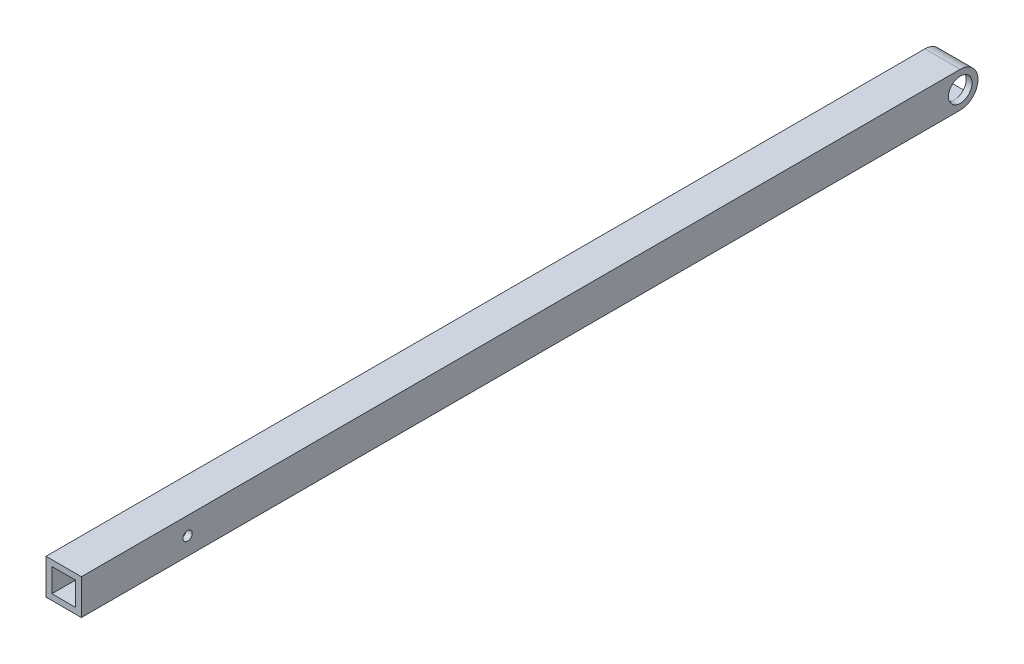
from build123d import *

# Parameters (mm, degrees)
SKETCH1_W           = 19.05
SKETCH1_H           = 19.05
SKETCH1_W_2         = 12.7
SKETCH1_H_2         = 12.7
BOSS_EXTRUDE1_DEPTH = 482.6
SKETCH2_R           = 6.35
CUT_EXTRUDE1_DEPTH  = 484.069754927
SKETCH3_R           = 2.4892
CUT_EXTRUDE2_DEPTH  = 484.069754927


with BuildPart() as part:
    # Sketch1 → Boss-Extrude1 (new body)
    with BuildSketch(Plane.XY):
        Rectangle(SKETCH1_W, SKETCH1_H)
        Rectangle(SKETCH1_W_2, SKETCH1_H_2, mode=Mode.SUBTRACT)
    extrude(amount=BOSS_EXTRUDE1_DEPTH)

    # Sketch2 → Cut-Extrude1 (cut, through all)
    with BuildSketch(Plane(origin=(9.525, 0, 0), x_dir=(0, 0, -1), z_dir=(1, 0, 0))):
        with Locations((-9.525, 0)):
            Circle(SKETCH2_R)
        with BuildLine():
            ThreePointArc((0, -2.6e-08), (-2.789807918, -6.7351921), (-9.525, -9.525))
            Line((-9.525, -9.525), (0, -9.525))
            Line((0, -9.525), (0, -2.6e-08))
        make_face()
        with BuildLine():
            ThreePointArc((-9.525, 9.525), (-2.7898079, 6.735192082), (0, -2.6e-08))
            Line((0, -2.6e-08), (0, 9.525))
            Line((0, 9.525), (-9.525, 9.525))
        make_face()
    extrude(amount=-CUT_EXTRUDE1_DEPTH, mode=Mode.SUBTRACT)

    # Sketch3 → Cut-Extrude2 (cut, through all)
    with BuildSketch(Plane.ZY.offset(9.525)):
        with Locations((425.4246, 0)):
            Circle(SKETCH3_R)
    extrude(amount=-CUT_EXTRUDE2_DEPTH, mode=Mode.SUBTRACT)


solid = part.part
